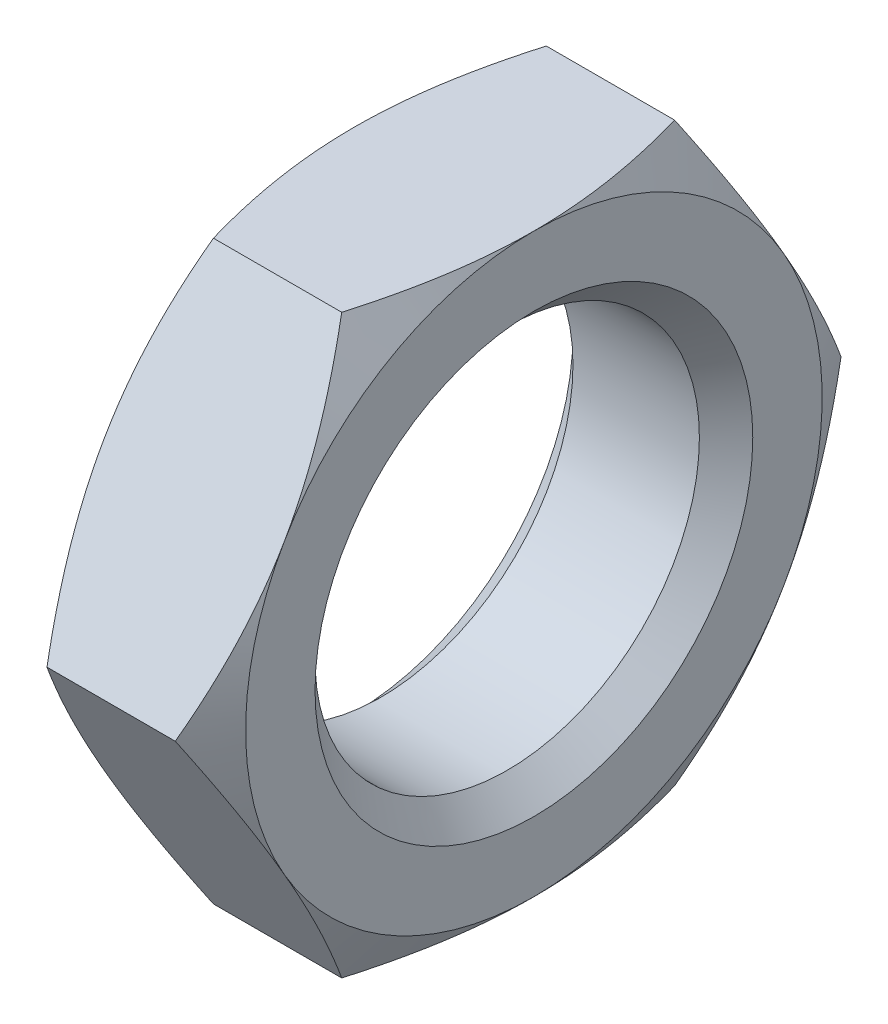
ISO-10303-21;
HEADER;
FILE_DESCRIPTION(('STEP AP214'),'2;1');
FILE_NAME('part.step','',(''),(''),'','','');
FILE_SCHEMA(('AUTOMOTIVE_DESIGN { 1 0 10303 214 1 1 1 1 }'));
ENDSEC;
DATA;
#1=APPLICATION_CONTEXT('core data for automotive mechanical design processes');
#2=APPLICATION_PROTOCOL_DEFINITION('international standard','automotive_design',2000,#1);
#3=PRODUCT_CONTEXT('',#1,'mechanical');
#4=PRODUCT('Part','Part','',(#3));
#5=PRODUCT_RELATED_PRODUCT_CATEGORY('part','',(#4));
#6=PRODUCT_DEFINITION_FORMATION('','',#4);
#7=PRODUCT_DEFINITION_CONTEXT('part definition',#1,'design');
#8=PRODUCT_DEFINITION('design','',#6,#7);
#9=PRODUCT_DEFINITION_SHAPE('','',#8);
#10=(LENGTH_UNIT() NAMED_UNIT(*) SI_UNIT(.MILLI.,.METRE.));
#11=(NAMED_UNIT(*) PLANE_ANGLE_UNIT() SI_UNIT($,.RADIAN.));
#12=(NAMED_UNIT(*) SI_UNIT($,.STERADIAN.) SOLID_ANGLE_UNIT());
#13=UNCERTAINTY_MEASURE_WITH_UNIT(LENGTH_MEASURE(1.E-05),#10,'distance_accuracy_value','');
#14=(GEOMETRIC_REPRESENTATION_CONTEXT(3) GLOBAL_UNCERTAINTY_ASSIGNED_CONTEXT((#13)) GLOBAL_UNIT_ASSIGNED_CONTEXT((#10,
#11,#12)) REPRESENTATION_CONTEXT('',''));
#15=CARTESIAN_POINT('',(0.,0.,0.));
#16=DIRECTION('',(0.,0.,1.));
#17=DIRECTION('',(1.,0.,0.));
#18=AXIS2_PLACEMENT_3D('',#15,#16,#17);
#19=CARTESIAN_POINT('',(8.42,13.5,-7.79422863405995));
#20=DIRECTION('',(1.,0.,0.));
#21=DIRECTION('',(0.,0.,-1.));
#22=AXIS2_PLACEMENT_3D('',#19,#20,#21);
#23=PLANE('',#22);
#24=CARTESIAN_POINT('',(8.42,0.,0.));
#25=DIRECTION('',(1.,0.,0.));
#26=DIRECTION('',(0.,0.,-1.));
#27=AXIS2_PLACEMENT_3D('',#24,#25,#26);
#28=CIRCLE('',#27,10.25);
#29=CARTESIAN_POINT('',(8.42,0.,-10.25));
#30=VERTEX_POINT('',#29);
#31=EDGE_CURVE('E11',#30,#30,#28,.F.);
#32=ORIENTED_EDGE('',*,*,#31,.T.);
#33=EDGE_LOOP('',(#32));
#34=FACE_BOUND('',#33,.T.);
#35=CARTESIAN_POINT('',(8.42,0.,0.));
#36=DIRECTION('',(1.,0.,0.));
#37=DIRECTION('',(0.,0.,-1.));
#38=AXIS2_PLACEMENT_3D('',#35,#36,#37);
#39=CIRCLE('',#38,13.5);
#40=CARTESIAN_POINT('',(8.42,-13.5,0.));
#41=VERTEX_POINT('',#40);
#42=CARTESIAN_POINT('',(8.42,-6.75,-11.6913429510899));
#43=VERTEX_POINT('',#42);
#44=EDGE_CURVE('E142',#41,#43,#39,.T.);
#45=ORIENTED_EDGE('',*,*,#44,.T.);
#46=CARTESIAN_POINT('',(8.42,6.75,-11.6913429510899));
#47=VERTEX_POINT('',#46);
#48=EDGE_CURVE('E130',#43,#47,#39,.T.);
#49=ORIENTED_EDGE('',*,*,#48,.T.);
#50=CARTESIAN_POINT('',(8.42,13.5,0.));
#51=VERTEX_POINT('',#50);
#52=EDGE_CURVE('E144',#47,#51,#39,.T.);
#53=ORIENTED_EDGE('',*,*,#52,.T.);
#54=CARTESIAN_POINT('',(8.42,6.75,11.6913429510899));
#55=VERTEX_POINT('',#54);
#56=EDGE_CURVE('E55',#51,#55,#39,.T.);
#57=ORIENTED_EDGE('',*,*,#56,.T.);
#58=CARTESIAN_POINT('',(8.42,-6.75,11.6913429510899));
#59=VERTEX_POINT('',#58);
#60=EDGE_CURVE('E63',#55,#59,#39,.T.);
#61=ORIENTED_EDGE('',*,*,#60,.T.);
#62=EDGE_CURVE('E166',#59,#41,#39,.T.);
#63=ORIENTED_EDGE('',*,*,#62,.T.);
#64=EDGE_LOOP('',(#45,#49,#53,#57,#61,#63));
#65=FACE_BOUND('',#64,.T.);
#66=ADVANCED_FACE('F39',(#34,#65),#23,.T.);
#67=CARTESIAN_POINT('',(0.,13.5,-7.79422863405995));
#68=DIRECTION('',(1.,0.,0.));
#69=DIRECTION('',(0.,0.,-1.));
#70=AXIS2_PLACEMENT_3D('',#67,#68,#69);
#71=PLANE('',#70);
#72=CARTESIAN_POINT('',(0.,0.,0.));
#73=DIRECTION('',(1.,0.,0.));
#74=DIRECTION('',(0.,0.,-1.));
#75=AXIS2_PLACEMENT_3D('',#72,#73,#74);
#76=CIRCLE('',#75,10.25);
#77=CARTESIAN_POINT('',(0.,0.,-10.25));
#78=VERTEX_POINT('',#77);
#79=EDGE_CURVE('E164',#78,#78,#76,.T.);
#80=ORIENTED_EDGE('',*,*,#79,.T.);
#81=EDGE_LOOP('',(#80));
#82=FACE_BOUND('',#81,.T.);
#83=CARTESIAN_POINT('',(0.,0.,0.));
#84=DIRECTION('',(1.,0.,0.));
#85=DIRECTION('',(0.,0.,-1.));
#86=AXIS2_PLACEMENT_3D('',#83,#84,#85);
#87=CIRCLE('',#86,13.5);
#88=CARTESIAN_POINT('',(0.,-6.75,-11.6913429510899));
#89=VERTEX_POINT('',#88);
#90=CARTESIAN_POINT('',(0.,6.75000000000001,-11.6913429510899));
#91=VERTEX_POINT('',#90);
#92=EDGE_CURVE('E172',#89,#91,#87,.T.);
#93=ORIENTED_EDGE('',*,*,#92,.F.);
#94=CARTESIAN_POINT('',(0.,-13.5,0.));
#95=VERTEX_POINT('',#94);
#96=EDGE_CURVE('E318',#95,#89,#87,.T.);
#97=ORIENTED_EDGE('',*,*,#96,.F.);
#98=CARTESIAN_POINT('',(0.,-6.75,11.6913429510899));
#99=VERTEX_POINT('',#98);
#100=EDGE_CURVE('E321',#99,#95,#87,.T.);
#101=ORIENTED_EDGE('',*,*,#100,.F.);
#102=CARTESIAN_POINT('',(0.,6.75,11.6913429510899));
#103=VERTEX_POINT('',#102);
#104=EDGE_CURVE('E327',#103,#99,#87,.T.);
#105=ORIENTED_EDGE('',*,*,#104,.F.);
#106=CARTESIAN_POINT('',(0.,13.5,0.));
#107=VERTEX_POINT('',#106);
#108=EDGE_CURVE('E177',#107,#103,#87,.T.);
#109=ORIENTED_EDGE('',*,*,#108,.F.);
#110=EDGE_CURVE('E173',#91,#107,#87,.T.);
#111=ORIENTED_EDGE('',*,*,#110,.F.);
#112=EDGE_LOOP('',(#93,#97,#101,#105,#109,#111));
#113=FACE_BOUND('',#112,.T.);
#114=ADVANCED_FACE('F319',(#82,#113),#71,.F.);
#115=CARTESIAN_POINT('',(8.42,0.,0.));
#116=DIRECTION('',(-1.,0.,0.));
#117=DIRECTION('',(0.,0.,1.));
#118=AXIS2_PLACEMENT_3D('',#115,#116,#117);
#119=CYLINDRICAL_SURFACE('',#118,9.);
#120=CARTESIAN_POINT('',(1.25,0.,0.));
#121=DIRECTION('',(1.,0.,0.));
#122=DIRECTION('',(0.,0.,-1.));
#123=AXIS2_PLACEMENT_3D('',#120,#121,#122);
#124=CIRCLE('',#123,9.);
#125=CARTESIAN_POINT('',(1.25,0.,-9.));
#126=VERTEX_POINT('',#125);
#127=EDGE_CURVE('E48',#126,#126,#124,.F.);
#128=ORIENTED_EDGE('',*,*,#127,.T.);
#129=EDGE_LOOP('',(#128));
#130=FACE_BOUND('',#129,.T.);
#131=CARTESIAN_POINT('',(7.17,0.,0.));
#132=DIRECTION('',(1.,0.,0.));
#133=DIRECTION('',(0.,0.,-1.));
#134=AXIS2_PLACEMENT_3D('',#131,#132,#133);
#135=CIRCLE('',#134,9.);
#136=CARTESIAN_POINT('',(7.17,0.,-9.));
#137=VERTEX_POINT('',#136);
#138=EDGE_CURVE('E409',#137,#137,#135,.T.);
#139=ORIENTED_EDGE('',*,*,#138,.T.);
#140=EDGE_LOOP('',(#139));
#141=FACE_BOUND('',#140,.T.);
#142=ADVANCED_FACE('F233',(#130,#141),#119,.F.);
#143=CARTESIAN_POINT('',(0.,0.,0.));
#144=DIRECTION('',(1.,0.,0.));
#145=DIRECTION('',(0.,0.,-1.));
#146=AXIS2_PLACEMENT_3D('',#143,#144,#145);
#147=CONICAL_SURFACE('',#146,13.5,1.0471975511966);
#148=CARTESIAN_POINT('',(1.20583803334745,-13.5002,-7.79411316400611));
#149=CARTESIAN_POINT('',(1.10693600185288,-13.2034751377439,-7.9654273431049));
#150=CARTESIAN_POINT('',(1.01252193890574,-12.9055928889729,-8.13740973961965));
#151=CARTESIAN_POINT('',(0.83391725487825,-12.3074397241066,-8.48275363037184));
#152=CARTESIAN_POINT('',(0.749729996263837,-12.0071680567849,-8.65611555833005));
#153=CARTESIAN_POINT('',(0.592710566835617,-11.403655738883,-9.00455355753));
#154=CARTESIAN_POINT('',(0.51990526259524,-11.1004098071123,-9.17963267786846));
#155=CARTESIAN_POINT('',(0.387213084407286,-10.4918107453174,-9.53100751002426));
#156=CARTESIAN_POINT('',(0.327325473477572,-10.1864577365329,-9.7073031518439));
#157=CARTESIAN_POINT('',(0.223015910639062,-9.58146884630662,-10.0565936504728));
#158=CARTESIAN_POINT('',(0.17824871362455,-9.28187788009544,-10.2295625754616));
#159=CARTESIAN_POINT('',(0.103183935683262,-8.68132315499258,-10.5762930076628));
#160=CARTESIAN_POINT('',(0.072886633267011,-8.38035936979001,-10.7500545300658));
#161=CARTESIAN_POINT('',(0.0275266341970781,-7.77792621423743,-11.0978694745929));
#162=CARTESIAN_POINT('',(0.0124458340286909,-7.47645787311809,-11.2719223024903));
#163=CARTESIAN_POINT('',(-0.00215683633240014,-6.87324289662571,-11.6201886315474));
#164=CARTESIAN_POINT('',(-0.0016791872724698,-6.57149627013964,-11.7944021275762));
#165=CARTESIAN_POINT('',(0.0137483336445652,-6.00738189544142,-12.1200937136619));
#166=CARTESIAN_POINT('',(0.0268164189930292,-5.74497394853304,-12.271595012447));
#167=CARTESIAN_POINT('',(0.0644725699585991,-5.22076165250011,-12.5742491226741));
#168=CARTESIAN_POINT('',(0.089061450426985,-4.95895734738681,-12.7254019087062));
#169=CARTESIAN_POINT('',(0.149330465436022,-4.43609453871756,-13.0272768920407));
#170=CARTESIAN_POINT('',(0.185019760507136,-4.17503683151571,-13.1779986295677));
#171=CARTESIAN_POINT('',(0.266863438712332,-3.65414530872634,-13.4787354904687));
#172=CARTESIAN_POINT('',(0.313018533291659,-3.39431157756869,-13.6287505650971));
#173=CARTESIAN_POINT('',(0.468349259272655,-2.60557180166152,-14.0841296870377));
#174=CARTESIAN_POINT('',(0.593013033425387,-2.07894982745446,-14.3881750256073));
#175=CARTESIAN_POINT('',(0.875948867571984,-1.03355849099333,-14.9917319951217));
#176=CARTESIAN_POINT('',(1.0341544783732,-0.514775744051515,-15.2912513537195));
#177=CARTESIAN_POINT('',(1.20583803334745,0.000200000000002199,-15.5885727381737));
#178=B_SPLINE_CURVE_WITH_KNOTS('',3,(#148,#149,#150,#151,#152,#153,#154,#155,#156,#157,#158,
#159,#160,#161,#162,#163,#164,#165,#166,#167,#168,#169,#170,#171,#172,#173,#174,#175,#176,#177),
.UNSPECIFIED.,.F.,.F.,(4,2,2,2,2,2,2,2,2,2,2,2,2,2,4),(0.,1.0698794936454,2.14010980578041,
3.21282939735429,4.28548777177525,5.33167033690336,6.37787303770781,7.42282956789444,
8.46775380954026,9.37738732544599,10.2870851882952,11.1975357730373,12.1080482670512,
13.9691139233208,15.8265265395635),.UNSPECIFIED.);
#179=CARTESIAN_POINT('',(1.20577136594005,0.,-15.5884572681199));
#180=VERTEX_POINT('',#179);
#181=EDGE_CURVE('E335',#89,#180,#178,.T.);
#182=ORIENTED_EDGE('',*,*,#181,.F.);
#183=ORIENTED_EDGE('',*,*,#92,.T.);
#184=CARTESIAN_POINT('',(1.20583803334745,-0.000199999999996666,-15.5885727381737));
#185=CARTESIAN_POINT('',(1.10693600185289,0.296524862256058,-15.4172585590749));
#186=CARTESIAN_POINT('',(1.01252193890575,0.594407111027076,-15.2452761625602));
#187=CARTESIAN_POINT('',(0.833917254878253,1.19256027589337,-14.899932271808));
#188=CARTESIAN_POINT('',(0.749729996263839,1.49283194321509,-14.7265703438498));
#189=CARTESIAN_POINT('',(0.592710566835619,2.09634426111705,-14.3781323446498));
#190=CARTESIAN_POINT('',(0.519905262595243,2.39959019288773,-14.2030532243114));
#191=CARTESIAN_POINT('',(0.387213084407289,3.00818925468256,-13.8516783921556));
#192=CARTESIAN_POINT('',(0.327325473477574,3.31354226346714,-13.6753827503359));
#193=CARTESIAN_POINT('',(0.223015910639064,3.91853115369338,-13.3260922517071));
#194=CARTESIAN_POINT('',(0.178248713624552,4.21812211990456,-13.1531233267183));
#195=CARTESIAN_POINT('',(0.103183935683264,4.81867684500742,-12.806392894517));
#196=CARTESIAN_POINT('',(0.0728866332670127,5.11964063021,-12.632631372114));
#197=CARTESIAN_POINT('',(0.0275266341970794,5.72207378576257,-12.284816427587));
#198=CARTESIAN_POINT('',(0.0124458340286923,6.02354212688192,-12.1107635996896));
#199=CARTESIAN_POINT('',(-0.00215683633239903,6.62675710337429,-11.7624972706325));
#200=CARTESIAN_POINT('',(-0.00167918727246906,6.92850372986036,-11.5882837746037));
#201=CARTESIAN_POINT('',(0.013748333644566,7.49261810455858,-11.2625921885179));
#202=CARTESIAN_POINT('',(0.0268164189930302,7.75502605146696,-11.1110908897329));
#203=CARTESIAN_POINT('',(0.0644725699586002,8.2792383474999,-10.8084367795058));
#204=CARTESIAN_POINT('',(0.0890614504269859,8.54104265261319,-10.6572839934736));
#205=CARTESIAN_POINT('',(0.149330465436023,9.06390546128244,-10.3554090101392));
#206=CARTESIAN_POINT('',(0.185019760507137,9.32496316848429,-10.2046872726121));
#207=CARTESIAN_POINT('',(0.266863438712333,9.84585469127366,-9.90395041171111));
#208=CARTESIAN_POINT('',(0.313018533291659,10.1056884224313,-9.75393533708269));
#209=CARTESIAN_POINT('',(0.468349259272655,10.8944281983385,-9.29855621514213));
#210=CARTESIAN_POINT('',(0.593013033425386,11.4210501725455,-8.99451087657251));
#211=CARTESIAN_POINT('',(0.875948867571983,12.4664415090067,-8.39095390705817));
#212=CARTESIAN_POINT('',(1.0341544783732,12.9852242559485,-8.09143454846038));
#213=CARTESIAN_POINT('',(1.20583803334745,13.5002,-7.79411316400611));
#214=B_SPLINE_CURVE_WITH_KNOTS('',3,(#184,#185,#186,#187,#188,#189,#190,#191,#192,#193,#194,
#195,#196,#197,#198,#199,#200,#201,#202,#203,#204,#205,#206,#207,#208,#209,#210,#211,#212,#213),
.UNSPECIFIED.,.F.,.F.,(4,2,2,2,2,2,2,2,2,2,2,2,2,2,4),(0.,1.0698794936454,2.14010980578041,
3.21282939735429,4.28548777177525,5.33167033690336,6.37787303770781,7.42282956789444,
8.46775380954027,9.37738732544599,10.2870851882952,11.1975357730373,12.1080482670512,
13.9691139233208,15.8265265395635),.UNSPECIFIED.);
#215=EDGE_CURVE('E214',#180,#91,#214,.T.);
#216=ORIENTED_EDGE('',*,*,#215,.F.);
#217=EDGE_LOOP('',(#182,#183,#216));
#218=FACE_BOUND('',#217,.T.);
#219=ADVANCED_FACE('F193',(#218),#147,.T.);
#220=ORIENTED_EDGE('',*,*,#96,.T.);
#221=CARTESIAN_POINT('',(1.20577136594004,-13.5,-7.79422863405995));
#222=VERTEX_POINT('',#221);
#223=EDGE_CURVE('E156',#222,#89,#178,.T.);
#224=ORIENTED_EDGE('',*,*,#223,.F.);
#225=CARTESIAN_POINT('',(6.6635537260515,-13.5,-21.0910505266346));
#226=CARTESIAN_POINT('',(6.5198852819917,-13.5,-20.795593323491));
#227=CARTESIAN_POINT('',(6.37692161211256,-13.5,-20.4997935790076));
#228=CARTESIAN_POINT('',(6.09256313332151,-13.5,-19.9074375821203));
#229=CARTESIAN_POINT('',(5.95116833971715,-13.5,-19.6108813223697));
#230=CARTESIAN_POINT('',(5.52953997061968,-13.5,-18.7198937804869));
#231=CARTESIAN_POINT('',(5.25190386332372,-13.5,-18.1242287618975));
#232=CARTESIAN_POINT('',(4.70374596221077,-13.5,-16.9257958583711));
#233=CARTESIAN_POINT('',(4.43326980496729,-13.5,-16.3230070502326));
#234=CARTESIAN_POINT('',(3.90317650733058,-13.5,-15.1126897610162));
#235=CARTESIAN_POINT('',(3.64355886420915,-13.5,-14.5051615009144));
#236=CARTESIAN_POINT('',(3.12967464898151,-13.5,-13.2641714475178));
#237=CARTESIAN_POINT('',(2.87587027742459,-13.5,-12.6305172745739));
#238=CARTESIAN_POINT('',(2.387097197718,-13.5,-11.3558484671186));
#239=CARTESIAN_POINT('',(2.15213058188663,-13.5,-10.7148330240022));
#240=CARTESIAN_POINT('',(1.70709208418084,-13.5,-9.42559312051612));
#241=CARTESIAN_POINT('',(1.49697110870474,-13.5,-8.77738574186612));
#242=CARTESIAN_POINT('',(1.10825137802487,-13.5,-7.47161266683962));
#243=CARTESIAN_POINT('',(0.929642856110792,-13.5,-6.81404993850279));
#244=CARTESIAN_POINT('',(0.692243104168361,-13.5,-5.82239691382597));
#245=CARTESIAN_POINT('',(0.618360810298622,-13.5,-5.49189850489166));
#246=CARTESIAN_POINT('',(0.481631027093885,-13.5,-4.82861507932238));
#247=CARTESIAN_POINT('',(0.418783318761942,-13.5,-4.4958301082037));
#248=CARTESIAN_POINT('',(0.305222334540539,-13.5,-3.82819174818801));
#249=CARTESIAN_POINT('',(0.254508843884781,-13.5,-3.49333839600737));
#250=CARTESIAN_POINT('',(0.166221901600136,-13.5,-2.82190527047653));
#251=CARTESIAN_POINT('',(0.128647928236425,-13.5,-2.48532556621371));
#252=CARTESIAN_POINT('',(0.0678663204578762,-13.5,-1.8153717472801));
#253=CARTESIAN_POINT('',(0.0444744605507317,-13.5,-1.48201444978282));
#254=CARTESIAN_POINT('',(0.0118169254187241,-13.5,-0.814609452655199));
#255=CARTESIAN_POINT('',(0.00255101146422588,-13.5,-0.480561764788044));
#256=CARTESIAN_POINT('',(-0.00163357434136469,-13.5,0.187626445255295));
#257=CARTESIAN_POINT('',(0.00344777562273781,-13.5,0.521766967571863));
#258=CARTESIAN_POINT('',(0.0278318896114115,-13.5,1.18953242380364));
#259=CARTESIAN_POINT('',(0.047135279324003,-13.5,1.52315733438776));
#260=CARTESIAN_POINT('',(0.109836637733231,-13.5,2.32032258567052));
#261=CARTESIAN_POINT('',(0.159724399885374,-13.5,2.78336177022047));
#262=CARTESIAN_POINT('',(0.284214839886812,-13.5,3.70610765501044));
#263=CARTESIAN_POINT('',(0.358820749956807,-13.5,4.16581391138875));
#264=CARTESIAN_POINT('',(0.530093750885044,-13.5,5.08142035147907));
#265=CARTESIAN_POINT('',(0.626777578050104,-13.5,5.53731737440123));
#266=CARTESIAN_POINT('',(0.839247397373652,-13.5,6.44458955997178));
#267=CARTESIAN_POINT('',(0.955033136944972,-13.5,6.89596478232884));
#268=CARTESIAN_POINT('',(1.20564296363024,-13.5,7.80421500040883));
#269=CARTESIAN_POINT('',(1.34083421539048,-13.5,8.26098797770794));
#270=CARTESIAN_POINT('',(1.62549782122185,-13.5,9.17003661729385));
#271=CARTESIAN_POINT('',(1.77497027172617,-13.5,9.62231224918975));
#272=CARTESIAN_POINT('',(2.08579571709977,-13.5,10.5225842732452));
#273=CARTESIAN_POINT('',(2.2471449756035,-13.5,10.9705819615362));
#274=CARTESIAN_POINT('',(2.57979520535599,-13.5,11.8628443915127));
#275=CARTESIAN_POINT('',(2.75109604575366,-13.5,12.3071091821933));
#276=CARTESIAN_POINT('',(3.17452710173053,-13.5,13.3752748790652));
#277=CARTESIAN_POINT('',(3.43080264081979,-13.5,13.9975302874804));
#278=CARTESIAN_POINT('',(3.95632089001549,-13.5,15.236558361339));
#279=CARTESIAN_POINT('',(4.22556449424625,-13.5,15.8533306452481));
#280=CARTESIAN_POINT('',(4.77435804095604,-13.5,17.0824441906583));
#281=CARTESIAN_POINT('',(5.05391053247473,-13.5,17.6947843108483));
#282=CARTESIAN_POINT('',(5.62118811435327,-13.5,18.9156391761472));
#283=CARTESIAN_POINT('',(5.9089130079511,-13.5,19.524154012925));
#284=CARTESIAN_POINT('',(6.49131570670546,-13.5,20.7387275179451));
#285=CARTESIAN_POINT('',(6.78600133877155,-13.5,21.3447824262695));
#286=CARTESIAN_POINT('',(7.38078386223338,-13.5,22.554230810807));
#287=CARTESIAN_POINT('',(7.68088077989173,-13.5,23.1576242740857));
#288=CARTESIAN_POINT('',(8.28549490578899,-13.5,24.362081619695));
#289=CARTESIAN_POINT('',(8.59001147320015,-13.5,24.9631458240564));
#290=CARTESIAN_POINT('',(9.20276866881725,-13.5,26.1633740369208));
#291=CARTESIAN_POINT('',(9.51100931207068,-13.5,26.7625380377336));
#292=CARTESIAN_POINT('',(10.3864339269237,-13.5,28.4533649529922));
#293=CARTESIAN_POINT('',(10.9572543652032,-13.5,29.5431449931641));
#294=CARTESIAN_POINT('',(12.1066254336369,-13.5,31.718665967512));
#295=CARTESIAN_POINT('',(12.6851763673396,-13.5,32.8044067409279));
#296=CARTESIAN_POINT('',(13.8466234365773,-13.5,34.9698373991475));
#297=CARTESIAN_POINT('',(14.4295038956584,-13.5,36.0495356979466));
#298=CARTESIAN_POINT('',(15.3072378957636,-13.5,37.6671877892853));
#299=CARTESIAN_POINT('',(15.6003762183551,-13.5,38.2060736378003));
#300=CARTESIAN_POINT('',(16.1876759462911,-13.5,39.2832865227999));
#301=CARTESIAN_POINT('',(16.4818373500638,-13.5,39.8216135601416));
#302=CARTESIAN_POINT('',(16.7764506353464,-13.5,40.3596932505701));
#303=B_SPLINE_CURVE_WITH_KNOTS('',3,(#225,#226,#227,#228,#229,#230,#231,#232,#233,#234,#235,
#236,#237,#238,#239,#240,#241,#242,#243,#244,#245,#246,#247,#248,#249,#250,#251,#252,#253,#254,
#255,#256,#257,#258,#259,#260,#261,#262,#263,#264,#265,#266,#267,#268,#269,#270,#271,#272,#273,
#274,#275,#276,#277,#278,#279,#280,#281,#282,#283,#284,#285,#286,#287,#288,#289,#290,#291,#292,
#293,#294,#295,#296,#297,#298,#299,#300,#301,#302),.UNSPECIFIED.,.F.,.F.,(4,2,2,2,2,2,2,2,2,2,2,
2,2,2,2,2,2,2,2,2,2,2,2,2,2,2,2,2,2,2,2,2,2,2,2,2,2,2,4),(0.,0.985604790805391,1.97121918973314,
3.94273175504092,5.92471918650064,7.90661475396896,9.95416736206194,12.0019470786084,
14.0456103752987,16.0886391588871,17.104452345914,18.1202453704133,19.136020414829,
20.1517551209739,21.1539957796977,22.156219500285,23.1584447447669,24.1607140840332,
25.557101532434,26.9536716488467,28.35130397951,29.7489178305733,31.1777174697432,
32.6065267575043,34.0348884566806,35.463231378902,37.4819173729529,39.5007427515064,
41.5200707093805,43.5393500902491,45.5610196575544,47.5826990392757,49.6040881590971,
51.6254854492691,55.3161168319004,59.0068935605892,62.6878405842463,64.5282072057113,
66.368571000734),.UNSPECIFIED.);
#304=EDGE_CURVE('E176',#95,#222,#303,.F.);
#305=ORIENTED_EDGE('',*,*,#304,.F.);
#306=EDGE_LOOP('',(#220,#224,#305));
#307=FACE_BOUND('',#306,.T.);
#308=ADVANCED_FACE('F352',(#307),#147,.T.);
#309=CARTESIAN_POINT('',(4.21,0.,0.));
#310=DIRECTION('',(-1.,0.,0.));
#311=DIRECTION('',(0.,0.,1.));
#312=AXIS2_PLACEMENT_3D('',#309,#310,#311);
#313=CONICAL_SURFACE('',#312,20.791933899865,1.0471975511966);
#314=CARTESIAN_POINT('',(7.21416196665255,0.000200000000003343,-15.5885727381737));
#315=CARTESIAN_POINT('',(7.31306399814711,-0.29652486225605,-15.4172585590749));
#316=CARTESIAN_POINT('',(7.40747806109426,-0.594407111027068,-15.2452761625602));
#317=CARTESIAN_POINT('',(7.58608274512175,-1.19256027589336,-14.899932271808));
#318=CARTESIAN_POINT('',(7.67027000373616,-1.49283194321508,-14.7265703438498));
#319=CARTESIAN_POINT('',(7.82728943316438,-2.09634426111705,-14.3781323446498));
#320=CARTESIAN_POINT('',(7.90009473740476,-2.39959019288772,-14.2030532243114));
#321=CARTESIAN_POINT('',(8.03278691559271,-3.00818925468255,-13.8516783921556));
#322=CARTESIAN_POINT('',(8.09267452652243,-3.31354226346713,-13.6753827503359));
#323=CARTESIAN_POINT('',(8.19698408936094,-3.91853115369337,-13.3260922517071));
#324=CARTESIAN_POINT('',(8.24175128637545,-4.21812211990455,-13.1531233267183));
#325=CARTESIAN_POINT('',(8.31681606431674,-4.81867684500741,-12.8063928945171));
#326=CARTESIAN_POINT('',(8.34711336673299,-5.11964063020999,-12.632631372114));
#327=CARTESIAN_POINT('',(8.39247336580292,-5.72207378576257,-12.284816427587));
#328=CARTESIAN_POINT('',(8.40755416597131,-6.02354212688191,-12.1107635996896));
#329=CARTESIAN_POINT('',(8.4221568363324,-6.62675710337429,-11.7624972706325));
#330=CARTESIAN_POINT('',(8.42167918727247,-6.92850372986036,-11.5882837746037));
#331=CARTESIAN_POINT('',(8.40625166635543,-7.49261810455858,-11.2625921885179));
#332=CARTESIAN_POINT('',(8.39318358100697,-7.75502605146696,-11.1110908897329));
#333=CARTESIAN_POINT('',(8.3555274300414,-8.27923834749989,-10.8084367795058));
#334=CARTESIAN_POINT('',(8.33093854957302,-8.54104265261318,-10.6572839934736));
#335=CARTESIAN_POINT('',(8.27066953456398,-9.06390546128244,-10.3554090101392));
#336=CARTESIAN_POINT('',(8.23498023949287,-9.32496316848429,-10.2046872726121));
#337=CARTESIAN_POINT('',(8.15313656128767,-9.84585469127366,-9.90395041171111));
#338=CARTESIAN_POINT('',(8.10698146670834,-10.1056884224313,-9.75393533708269));
#339=CARTESIAN_POINT('',(7.95165074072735,-10.8944281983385,-9.29855621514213));
#340=CARTESIAN_POINT('',(7.82698696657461,-11.4210501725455,-8.99451087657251));
#341=CARTESIAN_POINT('',(7.54405113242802,-12.4664415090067,-8.39095390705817));
#342=CARTESIAN_POINT('',(7.3858455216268,-12.9852242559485,-8.09143454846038));
#343=CARTESIAN_POINT('',(7.21416196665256,-13.5002,-7.79411316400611));
#344=B_SPLINE_CURVE_WITH_KNOTS('',3,(#314,#315,#316,#317,#318,#319,#320,#321,#322,#323,#324,
#325,#326,#327,#328,#329,#330,#331,#332,#333,#334,#335,#336,#337,#338,#339,#340,#341,#342,#343),
.UNSPECIFIED.,.F.,.F.,(4,2,2,2,2,2,2,2,2,2,2,2,2,2,4),(0.,1.0698794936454,2.14010980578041,
3.21282939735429,4.28548777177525,5.33167033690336,6.37787303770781,7.42282956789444,
8.46775380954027,9.37738732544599,10.2870851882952,11.1975357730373,12.1080482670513,
13.9691139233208,15.8265265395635),.UNSPECIFIED.);
#345=CARTESIAN_POINT('',(7.21422863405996,-13.5,-7.79422863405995));
#346=VERTEX_POINT('',#345);
#347=EDGE_CURVE('E147',#43,#346,#344,.T.);
#348=ORIENTED_EDGE('',*,*,#347,.F.);
#349=ORIENTED_EDGE('',*,*,#44,.F.);
#350=CARTESIAN_POINT('',(1.7564462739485,-13.5,-21.0910505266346));
#351=CARTESIAN_POINT('',(1.9001147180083,-13.5,-20.795593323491));
#352=CARTESIAN_POINT('',(2.04307838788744,-13.5,-20.4997935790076));
#353=CARTESIAN_POINT('',(2.32743686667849,-13.5,-19.9074375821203));
#354=CARTESIAN_POINT('',(2.46883166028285,-13.5,-19.6108813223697));
#355=CARTESIAN_POINT('',(2.89046002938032,-13.5,-18.7198937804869));
#356=CARTESIAN_POINT('',(3.16809613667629,-13.5,-18.1242287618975));
#357=CARTESIAN_POINT('',(3.71625403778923,-13.5,-16.9257958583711));
#358=CARTESIAN_POINT('',(3.98673019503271,-13.5,-16.3230070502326));
#359=CARTESIAN_POINT('',(4.51682349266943,-13.5,-15.1126897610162));
#360=CARTESIAN_POINT('',(4.77644113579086,-13.5,-14.5051615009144));
#361=CARTESIAN_POINT('',(5.2903253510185,-13.5,-13.2641714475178));
#362=CARTESIAN_POINT('',(5.54412972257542,-13.5,-12.6305172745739));
#363=CARTESIAN_POINT('',(6.032902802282,-13.5,-11.3558484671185));
#364=CARTESIAN_POINT('',(6.26786941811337,-13.5,-10.7148330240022));
#365=CARTESIAN_POINT('',(6.71290791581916,-13.5,-9.42559312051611));
#366=CARTESIAN_POINT('',(6.92302889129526,-13.5,-8.77738574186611));
#367=CARTESIAN_POINT('',(7.31174862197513,-13.5,-7.47161266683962));
#368=CARTESIAN_POINT('',(7.49035714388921,-13.5,-6.81404993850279));
#369=CARTESIAN_POINT('',(7.72775689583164,-13.5,-5.82239691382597));
#370=CARTESIAN_POINT('',(7.80163918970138,-13.5,-5.49189850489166));
#371=CARTESIAN_POINT('',(7.93836897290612,-13.5,-4.82861507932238));
#372=CARTESIAN_POINT('',(8.00121668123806,-13.5,-4.4958301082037));
#373=CARTESIAN_POINT('',(8.11477766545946,-13.5,-3.82819174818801));
#374=CARTESIAN_POINT('',(8.16549115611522,-13.5,-3.49333839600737));
#375=CARTESIAN_POINT('',(8.25377809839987,-13.5,-2.82190527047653));
#376=CARTESIAN_POINT('',(8.29135207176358,-13.5,-2.48532556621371));
#377=CARTESIAN_POINT('',(8.35213367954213,-13.5,-1.81537174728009));
#378=CARTESIAN_POINT('',(8.37552553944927,-13.5,-1.48201444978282));
#379=CARTESIAN_POINT('',(8.40818307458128,-13.5,-0.814609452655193));
#380=CARTESIAN_POINT('',(8.41744898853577,-13.5,-0.480561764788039));
#381=CARTESIAN_POINT('',(8.42163357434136,-13.5,0.187626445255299));
#382=CARTESIAN_POINT('',(8.41655222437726,-13.5,0.521766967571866));
#383=CARTESIAN_POINT('',(8.39216811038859,-13.5,1.18953242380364));
#384=CARTESIAN_POINT('',(8.372864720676,-13.5,1.52315733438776));
#385=CARTESIAN_POINT('',(8.31016336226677,-13.5,2.32032258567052));
#386=CARTESIAN_POINT('',(8.26027560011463,-13.5,2.78336177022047));
#387=CARTESIAN_POINT('',(8.13578516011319,-13.5,3.70610765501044));
#388=CARTESIAN_POINT('',(8.06117925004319,-13.5,4.16581391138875));
#389=CARTESIAN_POINT('',(7.88990624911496,-13.5,5.08142035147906));
#390=CARTESIAN_POINT('',(7.7932224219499,-13.5,5.53731737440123));
#391=CARTESIAN_POINT('',(7.58075260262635,-13.5,6.44458955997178));
#392=CARTESIAN_POINT('',(7.46496686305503,-13.5,6.89596478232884));
#393=CARTESIAN_POINT('',(7.21435703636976,-13.5,7.80421500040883));
#394=CARTESIAN_POINT('',(7.07916578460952,-13.5,8.26098797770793));
#395=CARTESIAN_POINT('',(6.79450217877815,-13.5,9.17003661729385));
#396=CARTESIAN_POINT('',(6.64502972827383,-13.5,9.62231224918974));
#397=CARTESIAN_POINT('',(6.33420428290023,-13.5,10.5225842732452));
#398=CARTESIAN_POINT('',(6.1728550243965,-13.5,10.9705819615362));
#399=CARTESIAN_POINT('',(5.84020479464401,-13.5,11.8628443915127));
#400=CARTESIAN_POINT('',(5.66890395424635,-13.5,12.3071091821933));
#401=CARTESIAN_POINT('',(5.24547289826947,-13.5,13.3752748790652));
#402=CARTESIAN_POINT('',(4.98919735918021,-13.5,13.9975302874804));
#403=CARTESIAN_POINT('',(4.46367910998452,-13.5,15.236558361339));
#404=CARTESIAN_POINT('',(4.19443550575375,-13.5,15.8533306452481));
#405=CARTESIAN_POINT('',(3.64564195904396,-13.5,17.0824441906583));
#406=CARTESIAN_POINT('',(3.36608946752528,-13.5,17.6947843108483));
#407=CARTESIAN_POINT('',(2.79881188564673,-13.5,18.9156391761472));
#408=CARTESIAN_POINT('',(2.5110869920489,-13.5,19.524154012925));
#409=CARTESIAN_POINT('',(1.92868429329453,-13.5,20.7387275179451));
#410=CARTESIAN_POINT('',(1.63399866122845,-13.5,21.3447824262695));
#411=CARTESIAN_POINT('',(1.03921613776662,-13.5,22.554230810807));
#412=CARTESIAN_POINT('',(0.739119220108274,-13.5,23.1576242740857));
#413=CARTESIAN_POINT('',(0.134505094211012,-13.5,24.362081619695));
#414=CARTESIAN_POINT('',(-0.170011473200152,-13.5,24.9631458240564));
#415=CARTESIAN_POINT('',(-0.782768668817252,-13.5,26.1633740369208));
#416=CARTESIAN_POINT('',(-1.09100931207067,-13.5,26.7625380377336));
#417=CARTESIAN_POINT('',(-1.96643392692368,-13.5,28.4533649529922));
#418=CARTESIAN_POINT('',(-2.53725436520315,-13.5,29.5431449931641));
#419=CARTESIAN_POINT('',(-3.6866254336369,-13.5,31.718665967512));
#420=CARTESIAN_POINT('',(-4.26517636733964,-13.5,32.8044067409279));
#421=CARTESIAN_POINT('',(-5.42662343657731,-13.5,34.9698373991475));
#422=CARTESIAN_POINT('',(-6.00950389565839,-13.5,36.0495356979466));
#423=CARTESIAN_POINT('',(-6.88723789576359,-13.5,37.6671877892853));
#424=CARTESIAN_POINT('',(-7.18037621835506,-13.5,38.2060736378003));
#425=CARTESIAN_POINT('',(-7.76767594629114,-13.5,39.2832865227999));
#426=CARTESIAN_POINT('',(-8.06183735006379,-13.5,39.8216135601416));
#427=CARTESIAN_POINT('',(-8.35645063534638,-13.5,40.3596932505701));
#428=B_SPLINE_CURVE_WITH_KNOTS('',3,(#350,#351,#352,#353,#354,#355,#356,#357,#358,#359,#360,
#361,#362,#363,#364,#365,#366,#367,#368,#369,#370,#371,#372,#373,#374,#375,#376,#377,#378,#379,
#380,#381,#382,#383,#384,#385,#386,#387,#388,#389,#390,#391,#392,#393,#394,#395,#396,#397,#398,
#399,#400,#401,#402,#403,#404,#405,#406,#407,#408,#409,#410,#411,#412,#413,#414,#415,#416,#417,
#418,#419,#420,#421,#422,#423,#424,#425,#426,#427),.UNSPECIFIED.,.F.,.F.,(4,2,2,2,2,2,2,2,2,2,2,
2,2,2,2,2,2,2,2,2,2,2,2,2,2,2,2,2,2,2,2,2,2,2,2,2,2,2,4),(0.,0.98560479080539,1.97121918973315,
3.94273175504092,5.92471918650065,7.90661475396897,9.95416736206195,12.0019470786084,
14.0456103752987,16.0886391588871,17.104452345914,18.1202453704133,19.136020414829,
20.1517551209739,21.1539957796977,22.156219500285,23.1584447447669,24.1607140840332,
25.557101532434,26.9536716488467,28.35130397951,29.7489178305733,31.1777174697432,
32.6065267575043,34.0348884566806,35.463231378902,37.4819173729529,39.5007427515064,
41.5200707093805,43.5393500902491,45.5610196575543,47.5826990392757,49.6040881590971,
51.625485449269,55.3161168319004,59.0068935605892,62.6878405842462,64.5282072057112,
66.3685710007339),.UNSPECIFIED.);
#429=EDGE_CURVE('E151',#346,#41,#428,.T.);
#430=ORIENTED_EDGE('',*,*,#429,.F.);
#431=EDGE_LOOP('',(#348,#349,#430));
#432=FACE_BOUND('',#431,.T.);
#433=ADVANCED_FACE('F148',(#432),#313,.T.);
#434=ORIENTED_EDGE('',*,*,#48,.F.);
#435=CARTESIAN_POINT('',(7.21422863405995,0.,-15.5884572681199));
#436=VERTEX_POINT('',#435);
#437=EDGE_CURVE('E134',#436,#43,#344,.T.);
#438=ORIENTED_EDGE('',*,*,#437,.F.);
#439=CARTESIAN_POINT('',(7.21416196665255,13.5002,-7.79411316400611));
#440=CARTESIAN_POINT('',(7.31306399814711,13.2034751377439,-7.9654273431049));
#441=CARTESIAN_POINT('',(7.40747806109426,12.9055928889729,-8.13740973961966));
#442=CARTESIAN_POINT('',(7.58608274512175,12.3074397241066,-8.48275363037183));
#443=CARTESIAN_POINT('',(7.67027000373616,12.0071680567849,-8.65611555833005));
#444=CARTESIAN_POINT('',(7.82728943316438,11.403655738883,-9.00455355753));
#445=CARTESIAN_POINT('',(7.90009473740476,11.1004098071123,-9.17963267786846));
#446=CARTESIAN_POINT('',(8.03278691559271,10.4918107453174,-9.53100751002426));
#447=CARTESIAN_POINT('',(8.09267452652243,10.1864577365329,-9.7073031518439));
#448=CARTESIAN_POINT('',(8.19698408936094,9.58146884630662,-10.0565936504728));
#449=CARTESIAN_POINT('',(8.24175128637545,9.28187788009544,-10.2295625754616));
#450=CARTESIAN_POINT('',(8.31681606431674,8.68132315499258,-10.5762930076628));
#451=CARTESIAN_POINT('',(8.34711336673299,8.38035936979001,-10.7500545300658));
#452=CARTESIAN_POINT('',(8.39247336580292,7.77792621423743,-11.0978694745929));
#453=CARTESIAN_POINT('',(8.40755416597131,7.47645787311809,-11.2719223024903));
#454=CARTESIAN_POINT('',(8.4221568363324,6.87324289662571,-11.6201886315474));
#455=CARTESIAN_POINT('',(8.42167918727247,6.57149627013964,-11.7944021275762));
#456=CARTESIAN_POINT('',(8.40625166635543,6.00738189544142,-12.1200937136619));
#457=CARTESIAN_POINT('',(8.39318358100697,5.74497394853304,-12.271595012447));
#458=CARTESIAN_POINT('',(8.3555274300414,5.22076165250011,-12.5742491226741));
#459=CARTESIAN_POINT('',(8.33093854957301,4.95895734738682,-12.7254019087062));
#460=CARTESIAN_POINT('',(8.27066953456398,4.43609453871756,-13.0272768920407));
#461=CARTESIAN_POINT('',(8.23498023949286,4.17503683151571,-13.1779986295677));
#462=CARTESIAN_POINT('',(8.15313656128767,3.65414530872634,-13.4787354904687));
#463=CARTESIAN_POINT('',(8.10698146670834,3.39431157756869,-13.6287505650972));
#464=CARTESIAN_POINT('',(7.95165074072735,2.60557180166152,-14.0841296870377));
#465=CARTESIAN_POINT('',(7.82698696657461,2.07894982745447,-14.3881750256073));
#466=CARTESIAN_POINT('',(7.54405113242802,1.03355849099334,-14.9917319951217));
#467=CARTESIAN_POINT('',(7.3858455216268,0.514775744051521,-15.2912513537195));
#468=CARTESIAN_POINT('',(7.21416196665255,-0.000199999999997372,-15.5885727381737));
#469=B_SPLINE_CURVE_WITH_KNOTS('',3,(#439,#440,#441,#442,#443,#444,#445,#446,#447,#448,#449,
#450,#451,#452,#453,#454,#455,#456,#457,#458,#459,#460,#461,#462,#463,#464,#465,#466,#467,#468),
.UNSPECIFIED.,.F.,.F.,(4,2,2,2,2,2,2,2,2,2,2,2,2,2,4),(0.,1.0698794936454,2.14010980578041,
3.21282939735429,4.28548777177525,5.33167033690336,6.37787303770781,7.42282956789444,
8.46775380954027,9.37738732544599,10.2870851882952,11.1975357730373,12.1080482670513,
13.9691139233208,15.8265265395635),.UNSPECIFIED.);
#470=EDGE_CURVE('E136',#47,#436,#469,.T.);
#471=ORIENTED_EDGE('',*,*,#470,.F.);
#472=EDGE_LOOP('',(#434,#438,#471));
#473=FACE_BOUND('',#472,.T.);
#474=ADVANCED_FACE('F132',(#473),#313,.T.);
#475=ORIENTED_EDGE('',*,*,#100,.T.);
#476=CARTESIAN_POINT('',(1.20577136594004,-13.5,7.79422863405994));
#477=VERTEX_POINT('',#476);
#478=EDGE_CURVE('E186',#477,#95,#303,.F.);
#479=ORIENTED_EDGE('',*,*,#478,.F.);
#480=CARTESIAN_POINT('',(1.20583803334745,0.000200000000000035,15.5885727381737));
#481=CARTESIAN_POINT('',(1.10693600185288,-0.296524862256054,15.4172585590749));
#482=CARTESIAN_POINT('',(1.01252193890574,-0.594407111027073,15.2452761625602));
#483=CARTESIAN_POINT('',(0.833917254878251,-1.19256027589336,14.899932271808));
#484=CARTESIAN_POINT('',(0.749729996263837,-1.49283194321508,14.7265703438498));
#485=CARTESIAN_POINT('',(0.592710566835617,-2.09634426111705,14.3781323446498));
#486=CARTESIAN_POINT('',(0.51990526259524,-2.39959019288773,14.2030532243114));
#487=CARTESIAN_POINT('',(0.387213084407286,-3.00818925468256,13.8516783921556));
#488=CARTESIAN_POINT('',(0.327325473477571,-3.31354226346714,13.6753827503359));
#489=CARTESIAN_POINT('',(0.223015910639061,-3.91853115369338,13.3260922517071));
#490=CARTESIAN_POINT('',(0.178248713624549,-4.21812211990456,13.1531233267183));
#491=CARTESIAN_POINT('',(0.103183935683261,-4.81867684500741,12.806392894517));
#492=CARTESIAN_POINT('',(0.0728866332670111,-5.11964063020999,12.632631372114));
#493=CARTESIAN_POINT('',(0.027526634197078,-5.72207378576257,12.284816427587));
#494=CARTESIAN_POINT('',(0.0124458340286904,-6.02354212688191,12.1107635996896));
#495=CARTESIAN_POINT('',(-0.0021568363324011,-6.62675710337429,11.7624972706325));
#496=CARTESIAN_POINT('',(-0.00167918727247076,-6.92850372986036,11.5882837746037));
#497=CARTESIAN_POINT('',(0.0137483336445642,-7.49261810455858,11.2625921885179));
#498=CARTESIAN_POINT('',(0.0268164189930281,-7.75502605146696,11.1110908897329));
#499=CARTESIAN_POINT('',(0.0644725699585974,-8.27923834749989,10.8084367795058));
#500=CARTESIAN_POINT('',(0.0890614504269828,-8.54104265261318,10.6572839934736));
#501=CARTESIAN_POINT('',(0.14933046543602,-9.06390546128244,10.3554090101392));
#502=CARTESIAN_POINT('',(0.185019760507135,-9.32496316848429,10.2046872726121));
#503=CARTESIAN_POINT('',(0.266863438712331,-9.84585469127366,9.90395041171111));
#504=CARTESIAN_POINT('',(0.313018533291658,-10.1056884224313,9.75393533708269));
#505=CARTESIAN_POINT('',(0.468349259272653,-10.8944281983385,9.29855621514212));
#506=CARTESIAN_POINT('',(0.593013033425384,-11.4210501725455,8.99451087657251));
#507=CARTESIAN_POINT('',(0.87594886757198,-12.4664415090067,8.39095390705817));
#508=CARTESIAN_POINT('',(1.0341544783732,-12.9852242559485,8.09143454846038));
#509=CARTESIAN_POINT('',(1.20583803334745,-13.5002,7.79411316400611));
#510=B_SPLINE_CURVE_WITH_KNOTS('',3,(#480,#481,#482,#483,#484,#485,#486,#487,#488,#489,#490,
#491,#492,#493,#494,#495,#496,#497,#498,#499,#500,#501,#502,#503,#504,#505,#506,#507,#508,#509),
.UNSPECIFIED.,.F.,.F.,(4,2,2,2,2,2,2,2,2,2,2,2,2,2,4),(0.,1.0698794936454,2.14010980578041,
3.21282939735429,4.28548777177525,5.33167033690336,6.37787303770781,7.42282956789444,
8.46775380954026,9.37738732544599,10.2870851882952,11.1975357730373,12.1080482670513,
13.9691139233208,15.8265265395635),.UNSPECIFIED.);
#511=EDGE_CURVE('E187',#99,#477,#510,.T.);
#512=ORIENTED_EDGE('',*,*,#511,.F.);
#513=EDGE_LOOP('',(#475,#479,#512));
#514=FACE_BOUND('',#513,.T.);
#515=ADVANCED_FACE('F351',(#514),#147,.T.);
#516=CARTESIAN_POINT('',(7.21422863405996,-13.5,7.79422863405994));
#517=VERTEX_POINT('',#516);
#518=EDGE_CURVE('E215',#41,#517,#428,.T.);
#519=ORIENTED_EDGE('',*,*,#518,.F.);
#520=ORIENTED_EDGE('',*,*,#62,.F.);
#521=CARTESIAN_POINT('',(7.21416196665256,-13.5002,7.79411316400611));
#522=CARTESIAN_POINT('',(7.31306399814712,-13.2034751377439,7.96542734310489));
#523=CARTESIAN_POINT('',(7.40747806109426,-12.9055928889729,8.13740973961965));
#524=CARTESIAN_POINT('',(7.58608274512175,-12.3074397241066,8.48275363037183));
#525=CARTESIAN_POINT('',(7.67027000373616,-12.0071680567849,8.65611555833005));
#526=CARTESIAN_POINT('',(7.82728943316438,-11.403655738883,9.00455355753));
#527=CARTESIAN_POINT('',(7.90009473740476,-11.1004098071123,9.17963267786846));
#528=CARTESIAN_POINT('',(8.03278691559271,-10.4918107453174,9.53100751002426));
#529=CARTESIAN_POINT('',(8.09267452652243,-10.1864577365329,9.7073031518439));
#530=CARTESIAN_POINT('',(8.19698408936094,-9.58146884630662,10.0565936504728));
#531=CARTESIAN_POINT('',(8.24175128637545,-9.28187788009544,10.2295625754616));
#532=CARTESIAN_POINT('',(8.31681606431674,-8.68132315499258,10.5762930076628));
#533=CARTESIAN_POINT('',(8.34711336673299,-8.38035936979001,10.7500545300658));
#534=CARTESIAN_POINT('',(8.39247336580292,-7.77792621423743,11.0978694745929));
#535=CARTESIAN_POINT('',(8.40755416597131,-7.47645787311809,11.2719223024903));
#536=CARTESIAN_POINT('',(8.4221568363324,-6.87324289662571,11.6201886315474));
#537=CARTESIAN_POINT('',(8.42167918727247,-6.57149627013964,11.7944021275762));
#538=CARTESIAN_POINT('',(8.40625166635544,-6.00738189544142,12.1200937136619));
#539=CARTESIAN_POINT('',(8.39318358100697,-5.74497394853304,12.271595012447));
#540=CARTESIAN_POINT('',(8.3555274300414,-5.22076165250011,12.5742491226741));
#541=CARTESIAN_POINT('',(8.33093854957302,-4.95895734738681,12.7254019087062));
#542=CARTESIAN_POINT('',(8.27066953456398,-4.43609453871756,13.0272768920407));
#543=CARTESIAN_POINT('',(8.23498023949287,-4.17503683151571,13.1779986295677));
#544=CARTESIAN_POINT('',(8.15313656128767,-3.65414530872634,13.4787354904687));
#545=CARTESIAN_POINT('',(8.10698146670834,-3.39431157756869,13.6287505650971));
#546=CARTESIAN_POINT('',(7.95165074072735,-2.60557180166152,14.0841296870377));
#547=CARTESIAN_POINT('',(7.82698696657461,-2.07894982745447,14.3881750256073));
#548=CARTESIAN_POINT('',(7.54405113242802,-1.03355849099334,14.9917319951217));
#549=CARTESIAN_POINT('',(7.3858455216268,-0.51477574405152,15.2912513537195));
#550=CARTESIAN_POINT('',(7.21416196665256,0.000199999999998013,15.5885727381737));
#551=B_SPLINE_CURVE_WITH_KNOTS('',3,(#521,#522,#523,#524,#525,#526,#527,#528,#529,#530,#531,
#532,#533,#534,#535,#536,#537,#538,#539,#540,#541,#542,#543,#544,#545,#546,#547,#548,#549,#550),
.UNSPECIFIED.,.F.,.F.,(4,2,2,2,2,2,2,2,2,2,2,2,2,2,4),(0.,1.0698794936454,2.14010980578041,
3.21282939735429,4.28548777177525,5.33167033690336,6.37787303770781,7.42282956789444,
8.46775380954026,9.37738732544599,10.2870851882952,11.1975357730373,12.1080482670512,
13.9691139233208,15.8265265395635),.UNSPECIFIED.);
#552=EDGE_CURVE('E246',#517,#59,#551,.T.);
#553=ORIENTED_EDGE('',*,*,#552,.F.);
#554=EDGE_LOOP('',(#519,#520,#553));
#555=FACE_BOUND('',#554,.T.);
#556=ADVANCED_FACE('F395',(#555),#313,.T.);
#557=ORIENTED_EDGE('',*,*,#104,.T.);
#558=CARTESIAN_POINT('',(1.20577136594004,0.,15.5884572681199));
#559=VERTEX_POINT('',#558);
#560=EDGE_CURVE('E287',#559,#99,#510,.T.);
#561=ORIENTED_EDGE('',*,*,#560,.F.);
#562=CARTESIAN_POINT('',(1.20583803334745,13.5002,7.79411316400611));
#563=CARTESIAN_POINT('',(1.10693600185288,13.2034751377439,7.9654273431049));
#564=CARTESIAN_POINT('',(1.01252193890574,12.9055928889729,8.13740973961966));
#565=CARTESIAN_POINT('',(0.833917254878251,12.3074397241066,8.48275363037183));
#566=CARTESIAN_POINT('',(0.749729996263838,12.0071680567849,8.65611555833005));
#567=CARTESIAN_POINT('',(0.592710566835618,11.403655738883,9.00455355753));
#568=CARTESIAN_POINT('',(0.519905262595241,11.1004098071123,9.17963267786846));
#569=CARTESIAN_POINT('',(0.387213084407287,10.4918107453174,9.53100751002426));
#570=CARTESIAN_POINT('',(0.327325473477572,10.1864577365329,9.7073031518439));
#571=CARTESIAN_POINT('',(0.223015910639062,9.58146884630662,10.0565936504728));
#572=CARTESIAN_POINT('',(0.17824871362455,9.28187788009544,10.2295625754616));
#573=CARTESIAN_POINT('',(0.103183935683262,8.68132315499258,10.5762930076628));
#574=CARTESIAN_POINT('',(0.0728866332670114,8.38035936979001,10.7500545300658));
#575=CARTESIAN_POINT('',(0.0275266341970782,7.77792621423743,11.0978694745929));
#576=CARTESIAN_POINT('',(0.0124458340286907,7.47645787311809,11.2719223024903));
#577=CARTESIAN_POINT('',(-0.00215683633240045,6.87324289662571,11.6201886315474));
#578=CARTESIAN_POINT('',(-0.00167918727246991,6.57149627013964,11.7944021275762));
#579=CARTESIAN_POINT('',(0.0137483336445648,6.00738189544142,12.1200937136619));
#580=CARTESIAN_POINT('',(0.0268164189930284,5.74497394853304,12.271595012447));
#581=CARTESIAN_POINT('',(0.064472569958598,5.22076165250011,12.5742491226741));
#582=CARTESIAN_POINT('',(0.0890614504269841,4.95895734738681,12.7254019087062));
#583=CARTESIAN_POINT('',(0.149330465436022,4.43609453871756,13.0272768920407));
#584=CARTESIAN_POINT('',(0.185019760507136,4.17503683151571,13.1779986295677));
#585=CARTESIAN_POINT('',(0.266863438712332,3.65414530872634,13.4787354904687));
#586=CARTESIAN_POINT('',(0.313018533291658,3.39431157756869,13.6287505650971));
#587=CARTESIAN_POINT('',(0.468349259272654,2.60557180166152,14.0841296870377));
#588=CARTESIAN_POINT('',(0.593013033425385,2.07894982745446,14.3881750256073));
#589=CARTESIAN_POINT('',(0.875948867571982,1.03355849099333,14.9917319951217));
#590=CARTESIAN_POINT('',(1.0341544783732,0.514775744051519,15.2912513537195));
#591=CARTESIAN_POINT('',(1.20583803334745,-0.000199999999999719,15.5885727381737));
#592=B_SPLINE_CURVE_WITH_KNOTS('',3,(#562,#563,#564,#565,#566,#567,#568,#569,#570,#571,#572,
#573,#574,#575,#576,#577,#578,#579,#580,#581,#582,#583,#584,#585,#586,#587,#588,#589,#590,#591),
.UNSPECIFIED.,.F.,.F.,(4,2,2,2,2,2,2,2,2,2,2,2,2,2,4),(0.,1.06987949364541,2.14010980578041,
3.21282939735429,4.28548777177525,5.33167033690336,6.37787303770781,7.42282956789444,
8.46775380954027,9.37738732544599,10.2870851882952,11.1975357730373,12.1080482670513,
13.9691139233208,15.8265265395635),.UNSPECIFIED.);
#593=EDGE_CURVE('E281',#103,#559,#592,.T.);
#594=ORIENTED_EDGE('',*,*,#593,.F.);
#595=EDGE_LOOP('',(#557,#561,#594));
#596=FACE_BOUND('',#595,.T.);
#597=ADVANCED_FACE('F231',(#596),#147,.T.);
#598=CARTESIAN_POINT('',(7.21422863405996,0.,15.5884572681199));
#599=VERTEX_POINT('',#598);
#600=EDGE_CURVE('E377',#59,#599,#551,.T.);
#601=ORIENTED_EDGE('',*,*,#600,.F.);
#602=ORIENTED_EDGE('',*,*,#60,.F.);
#603=CARTESIAN_POINT('',(7.21416196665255,-0.000200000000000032,15.5885727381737));
#604=CARTESIAN_POINT('',(7.31306399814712,0.296524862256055,15.4172585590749));
#605=CARTESIAN_POINT('',(7.40747806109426,0.594407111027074,15.2452761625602));
#606=CARTESIAN_POINT('',(7.58608274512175,1.19256027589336,14.899932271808));
#607=CARTESIAN_POINT('',(7.67027000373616,1.49283194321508,14.7265703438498));
#608=CARTESIAN_POINT('',(7.82728943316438,2.09634426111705,14.3781323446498));
#609=CARTESIAN_POINT('',(7.90009473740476,2.39959019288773,14.2030532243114));
#610=CARTESIAN_POINT('',(8.03278691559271,3.00818925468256,13.8516783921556));
#611=CARTESIAN_POINT('',(8.09267452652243,3.31354226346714,13.6753827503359));
#612=CARTESIAN_POINT('',(8.19698408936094,3.91853115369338,13.3260922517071));
#613=CARTESIAN_POINT('',(8.24175128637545,4.21812211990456,13.1531233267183));
#614=CARTESIAN_POINT('',(8.31681606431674,4.81867684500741,12.806392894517));
#615=CARTESIAN_POINT('',(8.34711336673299,5.11964063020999,12.632631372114));
#616=CARTESIAN_POINT('',(8.39247336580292,5.72207378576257,12.284816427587));
#617=CARTESIAN_POINT('',(8.40755416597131,6.02354212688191,12.1107635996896));
#618=CARTESIAN_POINT('',(8.4221568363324,6.62675710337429,11.7624972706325));
#619=CARTESIAN_POINT('',(8.42167918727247,6.92850372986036,11.5882837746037));
#620=CARTESIAN_POINT('',(8.40625166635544,7.49261810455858,11.2625921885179));
#621=CARTESIAN_POINT('',(8.39318358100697,7.75502605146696,11.1110908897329));
#622=CARTESIAN_POINT('',(8.3555274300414,8.27923834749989,10.8084367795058));
#623=CARTESIAN_POINT('',(8.33093854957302,8.54104265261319,10.6572839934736));
#624=CARTESIAN_POINT('',(8.27066953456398,9.06390546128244,10.3554090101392));
#625=CARTESIAN_POINT('',(8.23498023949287,9.32496316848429,10.2046872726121));
#626=CARTESIAN_POINT('',(8.15313656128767,9.84585469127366,9.90395041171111));
#627=CARTESIAN_POINT('',(8.10698146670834,10.1056884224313,9.75393533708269));
#628=CARTESIAN_POINT('',(7.95165074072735,10.8944281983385,9.29855621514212));
#629=CARTESIAN_POINT('',(7.82698696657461,11.4210501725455,8.99451087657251));
#630=CARTESIAN_POINT('',(7.54405113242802,12.4664415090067,8.39095390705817));
#631=CARTESIAN_POINT('',(7.3858455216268,12.9852242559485,8.09143454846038));
#632=CARTESIAN_POINT('',(7.21416196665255,13.5002,7.79411316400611));
#633=B_SPLINE_CURVE_WITH_KNOTS('',3,(#603,#604,#605,#606,#607,#608,#609,#610,#611,#612,#613,
#614,#615,#616,#617,#618,#619,#620,#621,#622,#623,#624,#625,#626,#627,#628,#629,#630,#631,#632),
.UNSPECIFIED.,.F.,.F.,(4,2,2,2,2,2,2,2,2,2,2,2,2,2,4),(0.,1.0698794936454,2.14010980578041,
3.21282939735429,4.28548777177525,5.33167033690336,6.37787303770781,7.42282956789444,
8.46775380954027,9.37738732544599,10.2870851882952,11.1975357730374,12.1080482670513,
13.9691139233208,15.8265265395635),.UNSPECIFIED.);
#634=EDGE_CURVE('E372',#599,#55,#633,.T.);
#635=ORIENTED_EDGE('',*,*,#634,.F.);
#636=EDGE_LOOP('',(#601,#602,#635));
#637=FACE_BOUND('',#636,.T.);
#638=ADVANCED_FACE('F226',(#637),#313,.T.);
#639=ORIENTED_EDGE('',*,*,#108,.T.);
#640=CARTESIAN_POINT('',(1.20577136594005,13.5,7.79422863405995));
#641=VERTEX_POINT('',#640);
#642=EDGE_CURVE('E280',#641,#103,#592,.T.);
#643=ORIENTED_EDGE('',*,*,#642,.F.);
#644=CARTESIAN_POINT('',(6.6635537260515,13.5,-21.0910505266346));
#645=CARTESIAN_POINT('',(6.5198852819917,13.5,-20.795593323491));
#646=CARTESIAN_POINT('',(6.37692161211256,13.5,-20.4997935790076));
#647=CARTESIAN_POINT('',(6.09256313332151,13.5,-19.9074375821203));
#648=CARTESIAN_POINT('',(5.95116833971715,13.5,-19.6108813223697));
#649=CARTESIAN_POINT('',(5.52953997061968,13.5,-18.7198937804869));
#650=CARTESIAN_POINT('',(5.25190386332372,13.5,-18.1242287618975));
#651=CARTESIAN_POINT('',(4.70374596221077,13.5,-16.9257958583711));
#652=CARTESIAN_POINT('',(4.43326980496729,13.5,-16.3230070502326));
#653=CARTESIAN_POINT('',(3.90317650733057,13.5,-15.1126897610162));
#654=CARTESIAN_POINT('',(3.64355886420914,13.5,-14.5051615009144));
#655=CARTESIAN_POINT('',(3.12967464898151,13.5,-13.2641714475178));
#656=CARTESIAN_POINT('',(2.87587027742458,13.5,-12.6305172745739));
#657=CARTESIAN_POINT('',(2.387097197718,13.5,-11.3558484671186));
#658=CARTESIAN_POINT('',(2.15213058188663,13.5,-10.7148330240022));
#659=CARTESIAN_POINT('',(1.70709208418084,13.5,-9.42559312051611));
#660=CARTESIAN_POINT('',(1.49697110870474,13.5,-8.77738574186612));
#661=CARTESIAN_POINT('',(1.10825137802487,13.5,-7.47161266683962));
#662=CARTESIAN_POINT('',(0.929642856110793,13.5,-6.81404993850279));
#663=CARTESIAN_POINT('',(0.692243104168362,13.5,-5.82239691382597));
#664=CARTESIAN_POINT('',(0.618360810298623,13.5,-5.49189850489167));
#665=CARTESIAN_POINT('',(0.481631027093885,13.5,-4.82861507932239));
#666=CARTESIAN_POINT('',(0.418783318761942,13.5,-4.4958301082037));
#667=CARTESIAN_POINT('',(0.305222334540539,13.5,-3.82819174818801));
#668=CARTESIAN_POINT('',(0.254508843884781,13.5,-3.49333839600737));
#669=CARTESIAN_POINT('',(0.166221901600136,13.5,-2.82190527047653));
#670=CARTESIAN_POINT('',(0.128647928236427,13.5,-2.48532556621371));
#671=CARTESIAN_POINT('',(0.0678663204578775,13.5,-1.8153717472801));
#672=CARTESIAN_POINT('',(0.0444744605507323,13.5,-1.48201444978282));
#673=CARTESIAN_POINT('',(0.0118169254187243,13.5,-0.814609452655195));
#674=CARTESIAN_POINT('',(0.00255101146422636,13.5,-0.48056176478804));
#675=CARTESIAN_POINT('',(-0.00163357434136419,13.5,0.187626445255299));
#676=CARTESIAN_POINT('',(0.00344777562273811,13.5,0.521766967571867));
#677=CARTESIAN_POINT('',(0.0278318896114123,13.5,1.18953242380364));
#678=CARTESIAN_POINT('',(0.0471352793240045,13.5,1.52315733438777));
#679=CARTESIAN_POINT('',(0.109836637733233,13.5,2.32032258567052));
#680=CARTESIAN_POINT('',(0.159724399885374,13.5,2.78336177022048));
#681=CARTESIAN_POINT('',(0.284214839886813,13.5,3.70610765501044));
#682=CARTESIAN_POINT('',(0.358820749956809,13.5,4.16581391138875));
#683=CARTESIAN_POINT('',(0.530093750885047,13.5,5.08142035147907));
#684=CARTESIAN_POINT('',(0.626777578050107,13.5,5.53731737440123));
#685=CARTESIAN_POINT('',(0.839247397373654,13.5,6.44458955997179));
#686=CARTESIAN_POINT('',(0.955033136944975,13.5,6.89596478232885));
#687=CARTESIAN_POINT('',(1.20564296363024,13.5,7.80421500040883));
#688=CARTESIAN_POINT('',(1.34083421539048,13.5,8.26098797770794));
#689=CARTESIAN_POINT('',(1.62549782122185,13.5,9.17003661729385));
#690=CARTESIAN_POINT('',(1.77497027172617,13.5,9.62231224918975));
#691=CARTESIAN_POINT('',(2.08579571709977,13.5,10.5225842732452));
#692=CARTESIAN_POINT('',(2.2471449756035,13.5,10.9705819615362));
#693=CARTESIAN_POINT('',(2.57979520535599,13.5,11.8628443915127));
#694=CARTESIAN_POINT('',(2.75109604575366,13.5,12.3071091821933));
#695=CARTESIAN_POINT('',(3.17452710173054,13.5,13.3752748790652));
#696=CARTESIAN_POINT('',(3.43080264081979,13.5,13.9975302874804));
#697=CARTESIAN_POINT('',(3.95632089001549,13.5,15.2365583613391));
#698=CARTESIAN_POINT('',(4.22556449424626,13.5,15.8533306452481));
#699=CARTESIAN_POINT('',(4.77435804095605,13.5,17.0824441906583));
#700=CARTESIAN_POINT('',(5.05391053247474,13.5,17.6947843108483));
#701=CARTESIAN_POINT('',(5.62118811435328,13.5,18.9156391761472));
#702=CARTESIAN_POINT('',(5.90891300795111,13.5,19.524154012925));
#703=CARTESIAN_POINT('',(6.49131570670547,13.5,20.7387275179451));
#704=CARTESIAN_POINT('',(6.78600133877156,13.5,21.3447824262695));
#705=CARTESIAN_POINT('',(7.38078386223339,13.5,22.554230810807));
#706=CARTESIAN_POINT('',(7.68088077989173,13.5,23.1576242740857));
#707=CARTESIAN_POINT('',(8.28549490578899,13.5,24.3620816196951));
#708=CARTESIAN_POINT('',(8.59001147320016,13.5,24.9631458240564));
#709=CARTESIAN_POINT('',(9.20276866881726,13.5,26.1633740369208));
#710=CARTESIAN_POINT('',(9.51100931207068,13.5,26.7625380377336));
#711=CARTESIAN_POINT('',(10.3864339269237,13.5,28.4533649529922));
#712=CARTESIAN_POINT('',(10.9572543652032,13.5,29.5431449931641));
#713=CARTESIAN_POINT('',(12.1066254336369,13.5,31.718665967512));
#714=CARTESIAN_POINT('',(12.6851763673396,13.5,32.8044067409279));
#715=CARTESIAN_POINT('',(13.8466234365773,13.5,34.9698373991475));
#716=CARTESIAN_POINT('',(14.4295038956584,13.5,36.0495356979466));
#717=CARTESIAN_POINT('',(15.3072378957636,13.5,37.6671877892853));
#718=CARTESIAN_POINT('',(15.6003762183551,13.5,38.2060736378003));
#719=CARTESIAN_POINT('',(16.1876759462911,13.5,39.2832865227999));
#720=CARTESIAN_POINT('',(16.4818373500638,13.5,39.8216135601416));
#721=CARTESIAN_POINT('',(16.7764506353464,13.5,40.3596932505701));
#722=B_SPLINE_CURVE_WITH_KNOTS('',3,(#644,#645,#646,#647,#648,#649,#650,#651,#652,#653,#654,
#655,#656,#657,#658,#659,#660,#661,#662,#663,#664,#665,#666,#667,#668,#669,#670,#671,#672,#673,
#674,#675,#676,#677,#678,#679,#680,#681,#682,#683,#684,#685,#686,#687,#688,#689,#690,#691,#692,
#693,#694,#695,#696,#697,#698,#699,#700,#701,#702,#703,#704,#705,#706,#707,#708,#709,#710,#711,
#712,#713,#714,#715,#716,#717,#718,#719,#720,#721),.UNSPECIFIED.,.F.,.F.,(4,2,2,2,2,2,2,2,2,2,2,
2,2,2,2,2,2,2,2,2,2,2,2,2,2,2,2,2,2,2,2,2,2,2,2,2,2,2,4),(0.,0.985604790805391,1.97121918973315,
3.94273175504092,5.92471918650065,7.90661475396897,9.95416736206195,12.0019470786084,
14.0456103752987,16.0886391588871,17.104452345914,18.1202453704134,19.136020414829,
20.1517551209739,21.1539957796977,22.156219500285,23.1584447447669,24.1607140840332,
25.557101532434,26.9536716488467,28.35130397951,29.7489178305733,31.1777174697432,
32.6065267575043,34.0348884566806,35.463231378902,37.481917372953,39.5007427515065,
41.5200707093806,43.5393500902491,45.5610196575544,47.5826990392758,49.6040881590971,
51.6254854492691,55.3161168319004,59.0068935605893,62.6878405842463,64.5282072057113,
66.368571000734),.UNSPECIFIED.);
#723=EDGE_CURVE('E273',#107,#641,#722,.T.);
#724=ORIENTED_EDGE('',*,*,#723,.F.);
#725=EDGE_LOOP('',(#639,#643,#724));
#726=FACE_BOUND('',#725,.T.);
#727=ADVANCED_FACE('F230',(#726),#147,.T.);
#728=ORIENTED_EDGE('',*,*,#56,.F.);
#729=CARTESIAN_POINT('',(1.7564462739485,13.5,-21.0910505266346));
#730=CARTESIAN_POINT('',(1.9001147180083,13.5,-20.795593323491));
#731=CARTESIAN_POINT('',(2.04307838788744,13.5,-20.4997935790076));
#732=CARTESIAN_POINT('',(2.32743686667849,13.5,-19.9074375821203));
#733=CARTESIAN_POINT('',(2.46883166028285,13.5,-19.6108813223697));
#734=CARTESIAN_POINT('',(2.89046002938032,13.5,-18.7198937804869));
#735=CARTESIAN_POINT('',(3.16809613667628,13.5,-18.1242287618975));
#736=CARTESIAN_POINT('',(3.71625403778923,13.5,-16.9257958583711));
#737=CARTESIAN_POINT('',(3.98673019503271,13.5,-16.3230070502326));
#738=CARTESIAN_POINT('',(4.51682349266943,13.5,-15.1126897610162));
#739=CARTESIAN_POINT('',(4.77644113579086,13.5,-14.5051615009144));
#740=CARTESIAN_POINT('',(5.29032535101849,13.5,-13.2641714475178));
#741=CARTESIAN_POINT('',(5.54412972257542,13.5,-12.6305172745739));
#742=CARTESIAN_POINT('',(6.032902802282,13.5,-11.3558484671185));
#743=CARTESIAN_POINT('',(6.26786941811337,13.5,-10.7148330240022));
#744=CARTESIAN_POINT('',(6.71290791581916,13.5,-9.42559312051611));
#745=CARTESIAN_POINT('',(6.92302889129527,13.5,-8.77738574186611));
#746=CARTESIAN_POINT('',(7.31174862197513,13.5,-7.47161266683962));
#747=CARTESIAN_POINT('',(7.49035714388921,13.5,-6.81404993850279));
#748=CARTESIAN_POINT('',(7.72775689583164,13.5,-5.82239691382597));
#749=CARTESIAN_POINT('',(7.80163918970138,13.5,-5.49189850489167));
#750=CARTESIAN_POINT('',(7.93836897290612,13.5,-4.82861507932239));
#751=CARTESIAN_POINT('',(8.00121668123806,13.5,-4.4958301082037));
#752=CARTESIAN_POINT('',(8.11477766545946,13.5,-3.82819174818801));
#753=CARTESIAN_POINT('',(8.16549115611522,13.5,-3.49333839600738));
#754=CARTESIAN_POINT('',(8.25377809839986,13.5,-2.82190527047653));
#755=CARTESIAN_POINT('',(8.29135207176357,13.5,-2.48532556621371));
#756=CARTESIAN_POINT('',(8.35213367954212,13.5,-1.8153717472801));
#757=CARTESIAN_POINT('',(8.37552553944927,13.5,-1.48201444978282));
#758=CARTESIAN_POINT('',(8.40818307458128,13.5,-0.814609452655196));
#759=CARTESIAN_POINT('',(8.41744898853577,13.5,-0.48056176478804));
#760=CARTESIAN_POINT('',(8.42163357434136,13.5,0.187626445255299));
#761=CARTESIAN_POINT('',(8.41655222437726,13.5,0.521766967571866));
#762=CARTESIAN_POINT('',(8.39216811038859,13.5,1.18953242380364));
#763=CARTESIAN_POINT('',(8.372864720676,13.5,1.52315733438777));
#764=CARTESIAN_POINT('',(8.31016336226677,13.5,2.32032258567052));
#765=CARTESIAN_POINT('',(8.26027560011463,13.5,2.78336177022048));
#766=CARTESIAN_POINT('',(8.13578516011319,13.5,3.70610765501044));
#767=CARTESIAN_POINT('',(8.06117925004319,13.5,4.16581391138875));
#768=CARTESIAN_POINT('',(7.88990624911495,13.5,5.08142035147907));
#769=CARTESIAN_POINT('',(7.79322242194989,13.5,5.53731737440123));
#770=CARTESIAN_POINT('',(7.58075260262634,13.5,6.44458955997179));
#771=CARTESIAN_POINT('',(7.46496686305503,13.5,6.89596478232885));
#772=CARTESIAN_POINT('',(7.21435703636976,13.5,7.80421500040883));
#773=CARTESIAN_POINT('',(7.07916578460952,13.5,8.26098797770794));
#774=CARTESIAN_POINT('',(6.79450217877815,13.5,9.17003661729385));
#775=CARTESIAN_POINT('',(6.64502972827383,13.5,9.62231224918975));
#776=CARTESIAN_POINT('',(6.33420428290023,13.5,10.5225842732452));
#777=CARTESIAN_POINT('',(6.1728550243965,13.5,10.9705819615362));
#778=CARTESIAN_POINT('',(5.84020479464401,13.5,11.8628443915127));
#779=CARTESIAN_POINT('',(5.66890395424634,13.5,12.3071091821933));
#780=CARTESIAN_POINT('',(5.24547289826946,13.5,13.3752748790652));
#781=CARTESIAN_POINT('',(4.98919735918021,13.5,13.9975302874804));
#782=CARTESIAN_POINT('',(4.46367910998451,13.5,15.236558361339));
#783=CARTESIAN_POINT('',(4.19443550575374,13.5,15.8533306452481));
#784=CARTESIAN_POINT('',(3.64564195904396,13.5,17.0824441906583));
#785=CARTESIAN_POINT('',(3.36608946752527,13.5,17.6947843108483));
#786=CARTESIAN_POINT('',(2.79881188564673,13.5,18.9156391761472));
#787=CARTESIAN_POINT('',(2.5110869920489,13.5,19.524154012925));
#788=CARTESIAN_POINT('',(1.92868429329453,13.5,20.7387275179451));
#789=CARTESIAN_POINT('',(1.63399866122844,13.5,21.3447824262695));
#790=CARTESIAN_POINT('',(1.03921613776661,13.5,22.554230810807));
#791=CARTESIAN_POINT('',(0.73911922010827,13.5,23.1576242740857));
#792=CARTESIAN_POINT('',(0.134505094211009,13.5,24.3620816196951));
#793=CARTESIAN_POINT('',(-0.170011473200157,13.5,24.9631458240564));
#794=CARTESIAN_POINT('',(-0.782768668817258,13.5,26.1633740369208));
#795=CARTESIAN_POINT('',(-1.09100931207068,13.5,26.7625380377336));
#796=CARTESIAN_POINT('',(-1.96643392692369,13.5,28.4533649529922));
#797=CARTESIAN_POINT('',(-2.53725436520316,13.5,29.5431449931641));
#798=CARTESIAN_POINT('',(-3.68662543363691,13.5,31.718665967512));
#799=CARTESIAN_POINT('',(-4.26517636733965,13.5,32.8044067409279));
#800=CARTESIAN_POINT('',(-5.42662343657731,13.5,34.9698373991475));
#801=CARTESIAN_POINT('',(-6.0095038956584,13.5,36.0495356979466));
#802=CARTESIAN_POINT('',(-6.8872378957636,13.5,37.6671877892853));
#803=CARTESIAN_POINT('',(-7.18037621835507,13.5,38.2060736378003));
#804=CARTESIAN_POINT('',(-7.76767594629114,13.5,39.2832865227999));
#805=CARTESIAN_POINT('',(-8.0618373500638,13.5,39.8216135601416));
#806=CARTESIAN_POINT('',(-8.35645063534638,13.5,40.3596932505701));
#807=B_SPLINE_CURVE_WITH_KNOTS('',3,(#729,#730,#731,#732,#733,#734,#735,#736,#737,#738,#739,
#740,#741,#742,#743,#744,#745,#746,#747,#748,#749,#750,#751,#752,#753,#754,#755,#756,#757,#758,
#759,#760,#761,#762,#763,#764,#765,#766,#767,#768,#769,#770,#771,#772,#773,#774,#775,#776,#777,
#778,#779,#780,#781,#782,#783,#784,#785,#786,#787,#788,#789,#790,#791,#792,#793,#794,#795,#796,
#797,#798,#799,#800,#801,#802,#803,#804,#805,#806),.UNSPECIFIED.,.F.,.F.,(4,2,2,2,2,2,2,2,2,2,2,
2,2,2,2,2,2,2,2,2,2,2,2,2,2,2,2,2,2,2,2,2,2,2,2,2,2,2,4),(0.,0.985604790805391,1.97121918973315,
3.94273175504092,5.92471918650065,7.90661475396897,9.95416736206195,12.0019470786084,
14.0456103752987,16.0886391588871,17.104452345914,18.1202453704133,19.136020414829,
20.1517551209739,21.1539957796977,22.156219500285,23.1584447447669,24.1607140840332,
25.557101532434,26.9536716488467,28.35130397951,29.7489178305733,31.1777174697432,
32.6065267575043,34.0348884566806,35.463231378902,37.481917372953,39.5007427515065,
41.5200707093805,43.5393500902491,45.5610196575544,47.5826990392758,49.6040881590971,
51.6254854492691,55.3161168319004,59.0068935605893,62.6878405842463,64.5282072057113,
66.368571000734),.UNSPECIFIED.);
#808=CARTESIAN_POINT('',(7.21422863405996,13.5,7.79422863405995));
#809=VERTEX_POINT('',#808);
#810=EDGE_CURVE('E258',#809,#51,#807,.F.);
#811=ORIENTED_EDGE('',*,*,#810,.F.);
#812=EDGE_CURVE('E259',#55,#809,#633,.T.);
#813=ORIENTED_EDGE('',*,*,#812,.F.);
#814=EDGE_LOOP('',(#728,#811,#813));
#815=FACE_BOUND('',#814,.T.);
#816=ADVANCED_FACE('F232',(#815),#313,.T.);
#817=ORIENTED_EDGE('',*,*,#110,.T.);
#818=CARTESIAN_POINT('',(1.20577136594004,13.5,-7.79422863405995));
#819=VERTEX_POINT('',#818);
#820=EDGE_CURVE('E279',#819,#107,#722,.T.);
#821=ORIENTED_EDGE('',*,*,#820,.F.);
#822=EDGE_CURVE('E216',#91,#819,#214,.T.);
#823=ORIENTED_EDGE('',*,*,#822,.F.);
#824=EDGE_LOOP('',(#817,#821,#823));
#825=FACE_BOUND('',#824,.T.);
#826=ADVANCED_FACE('F338',(#825),#147,.T.);
#827=ORIENTED_EDGE('',*,*,#52,.F.);
#828=CARTESIAN_POINT('',(7.21422863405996,13.5,-7.79422863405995));
#829=VERTEX_POINT('',#828);
#830=EDGE_CURVE('E384',#829,#47,#469,.T.);
#831=ORIENTED_EDGE('',*,*,#830,.F.);
#832=EDGE_CURVE('E251',#51,#829,#807,.F.);
#833=ORIENTED_EDGE('',*,*,#832,.F.);
#834=EDGE_LOOP('',(#827,#831,#833));
#835=FACE_BOUND('',#834,.T.);
#836=ADVANCED_FACE('F388',(#835),#313,.T.);
#837=CARTESIAN_POINT('',(8.42,-13.5,-7.79422863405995));
#838=DIRECTION('',(0.,0.5,0.866025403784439));
#839=DIRECTION('',(0.,-0.866025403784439,0.5));
#840=AXIS2_PLACEMENT_3D('',#837,#838,#839);
#841=PLANE('',#840);
#842=DIRECTION('',(-1.,0.,0.));
#843=VECTOR('',#842,1.);
#844=CARTESIAN_POINT('',(8.42,0.,-15.5884572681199));
#845=LINE('',#844,#843);
#846=EDGE_CURVE('E162',#436,#180,#845,.T.);
#847=ORIENTED_EDGE('',*,*,#846,.F.);
#848=ORIENTED_EDGE('',*,*,#437,.T.);
#849=ORIENTED_EDGE('',*,*,#347,.T.);
#850=DIRECTION('',(-1.,0.,0.));
#851=VECTOR('',#850,1.);
#852=CARTESIAN_POINT('',(8.42,-13.5,-7.79422863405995));
#853=LINE('',#852,#851);
#854=EDGE_CURVE('E369',#346,#222,#853,.T.);
#855=ORIENTED_EDGE('',*,*,#854,.T.);
#856=ORIENTED_EDGE('',*,*,#223,.T.);
#857=ORIENTED_EDGE('',*,*,#181,.T.);
#858=EDGE_LOOP('',(#847,#848,#849,#855,#856,#857));
#859=FACE_BOUND('',#858,.T.);
#860=ADVANCED_FACE('F159',(#859),#841,.F.);
#861=CARTESIAN_POINT('',(8.42,-13.5,7.79422863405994));
#862=DIRECTION('',(0.,1.,0.));
#863=DIRECTION('',(0.,0.,1.));
#864=AXIS2_PLACEMENT_3D('',#861,#862,#863);
#865=PLANE('',#864);
#866=ORIENTED_EDGE('',*,*,#854,.F.);
#867=ORIENTED_EDGE('',*,*,#429,.T.);
#868=ORIENTED_EDGE('',*,*,#518,.T.);
#869=DIRECTION('',(-1.,0.,0.));
#870=VECTOR('',#869,1.);
#871=CARTESIAN_POINT('',(8.42,-13.5,7.79422863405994));
#872=LINE('',#871,#870);
#873=EDGE_CURVE('E313',#517,#477,#872,.T.);
#874=ORIENTED_EDGE('',*,*,#873,.T.);
#875=ORIENTED_EDGE('',*,*,#478,.T.);
#876=ORIENTED_EDGE('',*,*,#304,.T.);
#877=EDGE_LOOP('',(#866,#867,#868,#874,#875,#876));
#878=FACE_BOUND('',#877,.T.);
#879=ADVANCED_FACE('F196',(#878),#865,.F.);
#880=CARTESIAN_POINT('',(8.42,0.,15.5884572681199));
#881=DIRECTION('',(0.,0.5,-0.866025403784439));
#882=DIRECTION('',(0.,0.866025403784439,0.5));
#883=AXIS2_PLACEMENT_3D('',#880,#881,#882);
#884=PLANE('',#883);
#885=ORIENTED_EDGE('',*,*,#873,.F.);
#886=ORIENTED_EDGE('',*,*,#552,.T.);
#887=ORIENTED_EDGE('',*,*,#600,.T.);
#888=DIRECTION('',(-1.,0.,0.));
#889=VECTOR('',#888,1.);
#890=CARTESIAN_POINT('',(8.42,0.,15.5884572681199));
#891=LINE('',#890,#889);
#892=EDGE_CURVE('E365',#599,#559,#891,.T.);
#893=ORIENTED_EDGE('',*,*,#892,.T.);
#894=ORIENTED_EDGE('',*,*,#560,.T.);
#895=ORIENTED_EDGE('',*,*,#511,.T.);
#896=EDGE_LOOP('',(#885,#886,#887,#893,#894,#895));
#897=FACE_BOUND('',#896,.T.);
#898=ADVANCED_FACE('F200',(#897),#884,.F.);
#899=CARTESIAN_POINT('',(8.42,13.5,7.79422863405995));
#900=DIRECTION('',(0.,-0.5,-0.866025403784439));
#901=DIRECTION('',(0.,0.866025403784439,-0.5));
#902=AXIS2_PLACEMENT_3D('',#899,#900,#901);
#903=PLANE('',#902);
#904=ORIENTED_EDGE('',*,*,#892,.F.);
#905=ORIENTED_EDGE('',*,*,#634,.T.);
#906=ORIENTED_EDGE('',*,*,#812,.T.);
#907=DIRECTION('',(-1.,0.,0.));
#908=VECTOR('',#907,1.);
#909=CARTESIAN_POINT('',(8.42,13.5,7.79422863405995));
#910=LINE('',#909,#908);
#911=EDGE_CURVE('E362',#809,#641,#910,.T.);
#912=ORIENTED_EDGE('',*,*,#911,.T.);
#913=ORIENTED_EDGE('',*,*,#642,.T.);
#914=ORIENTED_EDGE('',*,*,#593,.T.);
#915=EDGE_LOOP('',(#904,#905,#906,#912,#913,#914));
#916=FACE_BOUND('',#915,.T.);
#917=ADVANCED_FACE('F268',(#916),#903,.F.);
#918=CARTESIAN_POINT('',(8.42,13.5,-7.79422863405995));
#919=DIRECTION('',(0.,-1.,0.));
#920=DIRECTION('',(0.,0.,-1.));
#921=AXIS2_PLACEMENT_3D('',#918,#919,#920);
#922=PLANE('',#921);
#923=ORIENTED_EDGE('',*,*,#911,.F.);
#924=ORIENTED_EDGE('',*,*,#810,.T.);
#925=ORIENTED_EDGE('',*,*,#832,.T.);
#926=DIRECTION('',(-1.,0.,0.));
#927=VECTOR('',#926,1.);
#928=CARTESIAN_POINT('',(8.42,13.5,-7.79422863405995));
#929=LINE('',#928,#927);
#930=EDGE_CURVE('E355',#829,#819,#929,.T.);
#931=ORIENTED_EDGE('',*,*,#930,.T.);
#932=ORIENTED_EDGE('',*,*,#820,.T.);
#933=ORIENTED_EDGE('',*,*,#723,.T.);
#934=EDGE_LOOP('',(#923,#924,#925,#931,#932,#933));
#935=FACE_BOUND('',#934,.T.);
#936=ADVANCED_FACE('F264',(#935),#922,.F.);
#937=CARTESIAN_POINT('',(8.42,0.,-15.5884572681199));
#938=DIRECTION('',(0.,-0.5,0.866025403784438));
#939=DIRECTION('',(0.,-0.866025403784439,-0.5));
#940=AXIS2_PLACEMENT_3D('',#937,#938,#939);
#941=PLANE('',#940);
#942=ORIENTED_EDGE('',*,*,#930,.F.);
#943=ORIENTED_EDGE('',*,*,#830,.T.);
#944=ORIENTED_EDGE('',*,*,#470,.T.);
#945=ORIENTED_EDGE('',*,*,#846,.T.);
#946=ORIENTED_EDGE('',*,*,#215,.T.);
#947=ORIENTED_EDGE('',*,*,#822,.T.);
#948=EDGE_LOOP('',(#942,#943,#944,#945,#946,#947));
#949=FACE_BOUND('',#948,.T.);
#950=ADVANCED_FACE('F267',(#949),#941,.F.);
#951=CARTESIAN_POINT('',(0.,0.,0.));
#952=DIRECTION('',(-1.,0.,0.));
#953=DIRECTION('',(0.,0.,1.));
#954=AXIS2_PLACEMENT_3D('',#951,#952,#953);
#955=CONICAL_SURFACE('',#954,10.25,0.785398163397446);
#956=ORIENTED_EDGE('',*,*,#127,.F.);
#957=EDGE_LOOP('',(#956));
#958=FACE_BOUND('',#957,.T.);
#959=ORIENTED_EDGE('',*,*,#79,.F.);
#960=EDGE_LOOP('',(#959));
#961=FACE_BOUND('',#960,.T.);
#962=ADVANCED_FACE('F406',(#958,#961),#955,.F.);
#963=CARTESIAN_POINT('',(7.17,0.,0.));
#964=DIRECTION('',(1.,0.,0.));
#965=DIRECTION('',(0.,0.,-1.));
#966=AXIS2_PLACEMENT_3D('',#963,#964,#965);
#967=CONICAL_SURFACE('',#966,9.,0.785398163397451);
#968=ORIENTED_EDGE('',*,*,#31,.F.);
#969=EDGE_LOOP('',(#968));
#970=FACE_BOUND('',#969,.T.);
#971=ORIENTED_EDGE('',*,*,#138,.F.);
#972=EDGE_LOOP('',(#971));
#973=FACE_BOUND('',#972,.T.);
#974=ADVANCED_FACE('F41',(#970,#973),#967,.F.);
#975=CLOSED_SHELL('',(#66,#114,#142,#219,#308,#433,#474,#515,#556,#597,#638,#727,#816,#826,#836,
#860,#879,#898,#917,#936,#950,#962,#974));
#976=MANIFOLD_SOLID_BREP('B2',#975);
#977=ADVANCED_BREP_SHAPE_REPRESENTATION('',(#18,#976),#14);
#978=SHAPE_DEFINITION_REPRESENTATION(#9,#977);
ENDSEC;
END-ISO-10303-21;
